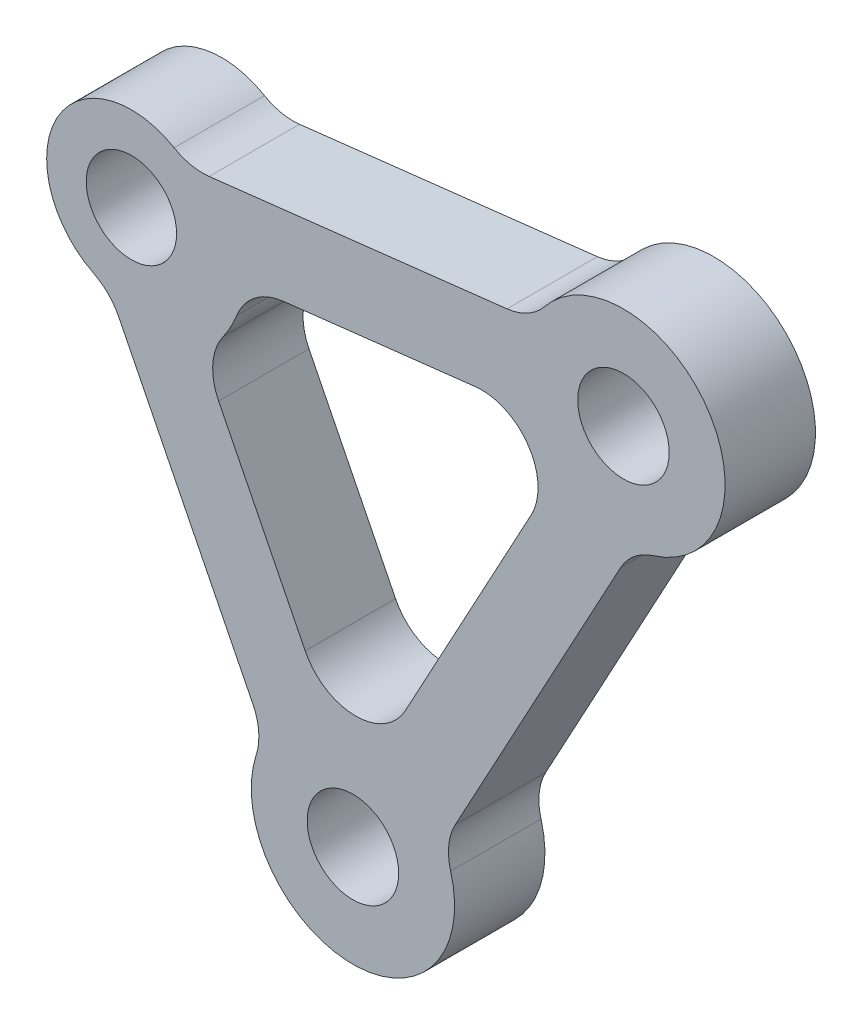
ISO-10303-21;
HEADER;
FILE_DESCRIPTION(('STEP AP214'),'2;1');
FILE_NAME('part.step','',(''),(''),'','','');
FILE_SCHEMA(('AUTOMOTIVE_DESIGN { 1 0 10303 214 1 1 1 1 }'));
ENDSEC;
DATA;
#1=APPLICATION_CONTEXT('core data for automotive mechanical design processes');
#2=APPLICATION_PROTOCOL_DEFINITION('international standard','automotive_design',2000,#1);
#3=PRODUCT_CONTEXT('',#1,'mechanical');
#4=PRODUCT('Part','Part','',(#3));
#5=PRODUCT_RELATED_PRODUCT_CATEGORY('part','',(#4));
#6=PRODUCT_DEFINITION_FORMATION('','',#4);
#7=PRODUCT_DEFINITION_CONTEXT('part definition',#1,'design');
#8=PRODUCT_DEFINITION('design','',#6,#7);
#9=PRODUCT_DEFINITION_SHAPE('','',#8);
#10=(LENGTH_UNIT() NAMED_UNIT(*) SI_UNIT(.MILLI.,.METRE.));
#11=(NAMED_UNIT(*) PLANE_ANGLE_UNIT() SI_UNIT($,.RADIAN.));
#12=(NAMED_UNIT(*) SI_UNIT($,.STERADIAN.) SOLID_ANGLE_UNIT());
#13=UNCERTAINTY_MEASURE_WITH_UNIT(LENGTH_MEASURE(1.E-05),#10,'distance_accuracy_value','');
#14=(GEOMETRIC_REPRESENTATION_CONTEXT(3) GLOBAL_UNCERTAINTY_ASSIGNED_CONTEXT((#13)) GLOBAL_UNIT_ASSIGNED_CONTEXT((#10,
#11,#12)) REPRESENTATION_CONTEXT('',''));
#15=CARTESIAN_POINT('',(0.,0.,0.));
#16=DIRECTION('',(0.,0.,1.));
#17=DIRECTION('',(1.,0.,0.));
#18=AXIS2_PLACEMENT_3D('',#15,#16,#17);
#19=CARTESIAN_POINT('',(16.022447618,205.375667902,-27.));
#20=DIRECTION('',(0.894403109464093,0.447261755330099,0.));
#21=DIRECTION('',(0.447261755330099,-0.894403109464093,0.));
#22=AXIS2_PLACEMENT_3D('',#19,#20,#21);
#23=PLANE('',#22);
#24=DIRECTION('',(0.,0.,-1.));
#25=VECTOR('',#24,1.);
#26=CARTESIAN_POINT('',(16.0224476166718,205.375667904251,-31.));
#27=LINE('',#26,#25);
#28=CARTESIAN_POINT('',(16.0224476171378,205.375667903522,-35.));
#29=VERTEX_POINT('',#28);
#30=CARTESIAN_POINT('',(16.0224476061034,205.37566790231,-27.));
#31=VERTEX_POINT('',#30);
#32=EDGE_CURVE('E308',#29,#31,#27,.F.);
#33=ORIENTED_EDGE('',*,*,#32,.F.);
#34=DIRECTION('',(0.447261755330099,-0.894403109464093,0.));
#35=VECTOR('',#34,1.);
#36=CARTESIAN_POINT('',(16.022447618,205.375667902,-35.));
#37=LINE('',#36,#35);
#38=CARTESIAN_POINT('',(27.8971255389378,181.629508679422,-35.));
#39=VERTEX_POINT('',#38);
#40=EDGE_CURVE('E249',#29,#39,#37,.T.);
#41=ORIENTED_EDGE('',*,*,#40,.T.);
#42=DIRECTION('',(0.,0.,1.));
#43=VECTOR('',#42,1.);
#44=CARTESIAN_POINT('',(27.8971255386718,181.629508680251,-31.));
#45=LINE('',#44,#43);
#46=CARTESIAN_POINT('',(27.8971255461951,181.629508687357,-27.));
#47=VERTEX_POINT('',#46);
#48=EDGE_CURVE('E185',#47,#39,#45,.F.);
#49=ORIENTED_EDGE('',*,*,#48,.F.);
#50=DIRECTION('',(0.44726175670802,-0.89440310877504,0.));
#51=VECTOR('',#50,1.);
#52=CARTESIAN_POINT('',(16.0224475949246,205.37566790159,-27.));
#53=LINE('',#52,#51);
#54=EDGE_CURVE('E290',#31,#47,#53,.T.);
#55=ORIENTED_EDGE('',*,*,#54,.F.);
#56=EDGE_LOOP('',(#33,#41,#49,#55));
#57=FACE_BOUND('',#56,.T.);
#58=ADVANCED_FACE('F12',(#57),#23,.F.);
#59=CARTESIAN_POINT('',(23.425109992,179.393199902,-35.));
#60=DIRECTION('',(0.,0.,1.));
#61=DIRECTION('',(1.,0.,0.));
#62=AXIS2_PLACEMENT_3D('',#59,#60,#61);
#63=CYLINDRICAL_SURFACE('',#62,5.00000000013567);
#64=CARTESIAN_POINT('',(23.425109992,179.393199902,-35.));
#65=DIRECTION('',(0.,0.,1.));
#66=DIRECTION('',(1.,0.,0.));
#67=AXIS2_PLACEMENT_3D('',#64,#65,#66);
#68=CIRCLE('',#67,5.00000000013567);
#69=CARTESIAN_POINT('',(28.184496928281,177.860804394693,-35.));
#70=VERTEX_POINT('',#69);
#71=EDGE_CURVE('E246',#39,#70,#68,.F.);
#72=ORIENTED_EDGE('',*,*,#71,.T.);
#73=DIRECTION('',(0.,0.,-1.));
#74=VECTOR('',#73,1.);
#75=CARTESIAN_POINT('',(28.184496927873,177.860804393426,-31.));
#76=LINE('',#75,#74);
#77=CARTESIAN_POINT('',(28.1844969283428,177.860804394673,-27.));
#78=VERTEX_POINT('',#77);
#79=EDGE_CURVE('E182',#70,#78,#76,.F.);
#80=ORIENTED_EDGE('',*,*,#79,.T.);
#81=CARTESIAN_POINT('',(23.425109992,179.393199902,-27.));
#82=DIRECTION('',(0.,0.,1.));
#83=DIRECTION('',(1.,0.,0.));
#84=AXIS2_PLACEMENT_3D('',#81,#82,#83);
#85=CIRCLE('',#84,5.00000000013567);
#86=EDGE_CURVE('E289',#47,#78,#85,.F.);
#87=ORIENTED_EDGE('',*,*,#86,.F.);
#88=ORIENTED_EDGE('',*,*,#48,.T.);
#89=EDGE_LOOP('',(#72,#80,#87,#88));
#90=FACE_BOUND('',#89,.T.);
#91=ADVANCED_FACE('F341',(#90),#63,.F.);
#92=CARTESIAN_POINT('',(36.751393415,175.102492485,-35.));
#93=DIRECTION('',(0.,0.,1.));
#94=DIRECTION('',(1.,0.,0.));
#95=AXIS2_PLACEMENT_3D('',#92,#93,#94);
#96=CYLINDRICAL_SURFACE('',#95,9.00000000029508);
#97=ORIENTED_EDGE('',*,*,#79,.F.);
#98=CARTESIAN_POINT('',(36.751393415,175.102492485,-35.));
#99=DIRECTION('',(0.,0.,1.));
#100=DIRECTION('',(1.,0.,0.));
#101=AXIS2_PLACEMENT_3D('',#98,#99,#100);
#102=CIRCLE('',#101,9.00000000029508);
#103=CARTESIAN_POINT('',(45.4034651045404,177.580728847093,-35.));
#104=VERTEX_POINT('',#103);
#105=EDGE_CURVE('E243',#70,#104,#102,.T.);
#106=ORIENTED_EDGE('',*,*,#105,.T.);
#107=DIRECTION('',(0.,0.,1.));
#108=VECTOR('',#107,1.);
#109=CARTESIAN_POINT('',(45.4034651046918,177.580728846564,-31.));
#110=LINE('',#109,#108);
#111=CARTESIAN_POINT('',(45.4034651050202,177.58072884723,-27.));
#112=VERTEX_POINT('',#111);
#113=EDGE_CURVE('E180',#112,#104,#110,.F.);
#114=ORIENTED_EDGE('',*,*,#113,.F.);
#115=CARTESIAN_POINT('',(36.751393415,175.102492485,-27.));
#116=DIRECTION('',(0.,0.,1.));
#117=DIRECTION('',(1.,0.,0.));
#118=AXIS2_PLACEMENT_3D('',#115,#116,#117);
#119=CIRCLE('',#118,9.00000000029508);
#120=EDGE_CURVE('E287',#78,#112,#119,.T.);
#121=ORIENTED_EDGE('',*,*,#120,.F.);
#122=EDGE_LOOP('',(#97,#106,#114,#121));
#123=FACE_BOUND('',#122,.T.);
#124=ADVANCED_FACE('F346',(#123),#96,.T.);
#125=CARTESIAN_POINT('',(50.210171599,178.957526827,-35.));
#126=DIRECTION('',(0.,0.,1.));
#127=DIRECTION('',(1.,0.,0.));
#128=AXIS2_PLACEMENT_3D('',#125,#126,#127);
#129=CYLINDRICAL_SURFACE('',#128,5.00000000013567);
#130=CARTESIAN_POINT('',(50.210171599,178.957526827,-35.));
#131=DIRECTION('',(0.,0.,1.));
#132=DIRECTION('',(1.,0.,0.));
#133=AXIS2_PLACEMENT_3D('',#130,#131,#132);
#134=CIRCLE('',#133,5.00000000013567);
#135=CARTESIAN_POINT('',(45.8132519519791,181.338093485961,-35.));
#136=VERTEX_POINT('',#135);
#137=EDGE_CURVE('E240',#104,#136,#134,.F.);
#138=ORIENTED_EDGE('',*,*,#137,.T.);
#139=DIRECTION('',(0.,0.,1.));
#140=VECTOR('',#139,1.);
#141=CARTESIAN_POINT('',(45.813251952,181.338093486,-31.));
#142=LINE('',#141,#140);
#143=CARTESIAN_POINT('',(45.8132519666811,181.338093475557,-27.));
#144=VERTEX_POINT('',#143);
#145=EDGE_CURVE('E174',#136,#144,#142,.T.);
#146=ORIENTED_EDGE('',*,*,#145,.T.);
#147=CARTESIAN_POINT('',(50.210171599,178.957526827,-27.));
#148=DIRECTION('',(0.,0.,1.));
#149=DIRECTION('',(1.,0.,0.));
#150=AXIS2_PLACEMENT_3D('',#147,#148,#149);
#151=CIRCLE('',#150,5.00000000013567);
#152=EDGE_CURVE('E285',#112,#144,#151,.F.);
#153=ORIENTED_EDGE('',*,*,#152,.F.);
#154=ORIENTED_EDGE('',*,*,#113,.T.);
#155=EDGE_LOOP('',(#138,#146,#153,#154));
#156=FACE_BOUND('',#155,.T.);
#157=ADVANCED_FACE('F349',(#156),#129,.F.);
#158=CARTESIAN_POINT('',(45.813251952,181.338093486,-27.));
#159=DIRECTION('',(-0.879383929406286,0.476113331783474,0.));
#160=DIRECTION('',(0.476113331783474,0.879383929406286,0.));
#161=AXIS2_PLACEMENT_3D('',#158,#159,#160);
#162=PLANE('',#161);
#163=ORIENTED_EDGE('',*,*,#145,.F.);
#164=DIRECTION('',(0.476113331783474,0.879383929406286,0.));
#165=VECTOR('',#164,1.);
#166=CARTESIAN_POINT('',(45.813251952,181.338093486,-35.));
#167=LINE('',#166,#165);
#168=CARTESIAN_POINT('',(60.4318747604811,208.338769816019,-35.));
#169=VERTEX_POINT('',#168);
#170=EDGE_CURVE('E237',#136,#169,#167,.T.);
#171=ORIENTED_EDGE('',*,*,#170,.T.);
#172=DIRECTION('',(0.,0.,1.));
#173=VECTOR('',#172,1.);
#174=CARTESIAN_POINT('',(60.431874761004,208.338769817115,-31.));
#175=LINE('',#174,#173);
#176=CARTESIAN_POINT('',(60.4318747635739,208.3387698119,-27.));
#177=VERTEX_POINT('',#176);
#178=EDGE_CURVE('E170',#177,#169,#175,.F.);
#179=ORIENTED_EDGE('',*,*,#178,.F.);
#180=DIRECTION('',(0.476113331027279,0.879383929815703,0.));
#181=VECTOR('',#180,1.);
#182=CARTESIAN_POINT('',(45.8132519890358,181.338093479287,-27.));
#183=LINE('',#182,#181);
#184=EDGE_CURVE('E151',#144,#177,#183,.T.);
#185=ORIENTED_EDGE('',*,*,#184,.F.);
#186=EDGE_LOOP('',(#163,#171,#179,#185));
#187=FACE_BOUND('',#186,.T.);
#188=ADVANCED_FACE('F352',(#187),#162,.F.);
#189=CARTESIAN_POINT('',(64.828794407,205.958203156,-35.));
#190=DIRECTION('',(0.,0.,1.));
#191=DIRECTION('',(1.,0.,0.));
#192=AXIS2_PLACEMENT_3D('',#189,#190,#191);
#193=CYLINDRICAL_SURFACE('',#192,5.00000000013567);
#194=CARTESIAN_POINT('',(64.828794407,205.958203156,-27.));
#195=DIRECTION('',(0.,0.,1.));
#196=DIRECTION('',(1.,0.,0.));
#197=AXIS2_PLACEMENT_3D('',#194,#195,#196);
#198=CIRCLE('',#197,5.00000000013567);
#199=CARTESIAN_POINT('',(63.3541871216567,210.735810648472,-27.));
#200=VERTEX_POINT('',#199);
#201=EDGE_CURVE('E144',#177,#200,#198,.F.);
#202=ORIENTED_EDGE('',*,*,#201,.F.);
#203=ORIENTED_EDGE('',*,*,#178,.T.);
#204=CARTESIAN_POINT('',(64.828794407,205.958203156,-35.));
#205=DIRECTION('',(0.,0.,1.));
#206=DIRECTION('',(1.,0.,0.));
#207=AXIS2_PLACEMENT_3D('',#204,#205,#206);
#208=CIRCLE('',#207,5.00000000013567);
#209=CARTESIAN_POINT('',(63.3541871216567,210.735810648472,-35.));
#210=VERTEX_POINT('',#209);
#211=EDGE_CURVE('E168',#169,#210,#208,.F.);
#212=ORIENTED_EDGE('',*,*,#211,.T.);
#213=DIRECTION('',(0.,0.,-1.));
#214=VECTOR('',#213,1.);
#215=CARTESIAN_POINT('',(63.3541871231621,210.735810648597,-31.));
#216=LINE('',#215,#214);
#217=EDGE_CURVE('E160',#210,#200,#216,.F.);
#218=ORIENTED_EDGE('',*,*,#217,.T.);
#219=EDGE_LOOP('',(#202,#203,#212,#218));
#220=FACE_BOUND('',#219,.T.);
#221=ADVANCED_FACE('F166',(#220),#193,.F.);
#222=CARTESIAN_POINT('',(60.699894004,219.335504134,-35.));
#223=DIRECTION('',(0.,0.,1.));
#224=DIRECTION('',(1.,0.,0.));
#225=AXIS2_PLACEMENT_3D('',#222,#223,#224);
#226=CYLINDRICAL_SURFACE('',#225,9.0000000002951);
#227=CARTESIAN_POINT('',(60.699894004,219.335504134,-35.));
#228=DIRECTION('',(0.,0.,1.));
#229=DIRECTION('',(1.,0.,0.));
#230=AXIS2_PLACEMENT_3D('',#227,#228,#229);
#231=CIRCLE('',#230,9.0000000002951);
#232=CARTESIAN_POINT('',(53.7072171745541,225.001408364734,-35.));
#233=VERTEX_POINT('',#232);
#234=EDGE_CURVE('E234',#210,#233,#231,.T.);
#235=ORIENTED_EDGE('',*,*,#234,.T.);
#236=DIRECTION('',(0.,0.,1.));
#237=VECTOR('',#236,1.);
#238=CARTESIAN_POINT('',(53.7072171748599,225.001408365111,-31.));
#239=LINE('',#238,#237);
#240=CARTESIAN_POINT('',(53.7072171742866,225.001408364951,-27.));
#241=VERTEX_POINT('',#240);
#242=EDGE_CURVE('E161',#241,#233,#239,.F.);
#243=ORIENTED_EDGE('',*,*,#242,.F.);
#244=CARTESIAN_POINT('',(60.699894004,219.335504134,-27.));
#245=DIRECTION('',(0.,0.,1.));
#246=DIRECTION('',(1.,0.,0.));
#247=AXIS2_PLACEMENT_3D('',#244,#245,#246);
#248=CIRCLE('',#247,9.0000000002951);
#249=EDGE_CURVE('E148',#200,#241,#248,.T.);
#250=ORIENTED_EDGE('',*,*,#249,.F.);
#251=ORIENTED_EDGE('',*,*,#217,.F.);
#252=EDGE_LOOP('',(#235,#243,#250,#251));
#253=FACE_BOUND('',#252,.T.);
#254=ADVANCED_FACE('F159',(#253),#226,.T.);
#255=CARTESIAN_POINT('',(49.822396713,228.149132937,-35.));
#256=DIRECTION('',(0.,0.,1.));
#257=DIRECTION('',(1.,0.,0.));
#258=AXIS2_PLACEMENT_3D('',#255,#256,#257);
#259=CYLINDRICAL_SURFACE('',#258,5.00000000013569);
#260=CARTESIAN_POINT('',(49.822396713,228.149132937,-35.));
#261=DIRECTION('',(0.,0.,1.));
#262=DIRECTION('',(1.,0.,0.));
#263=AXIS2_PLACEMENT_3D('',#260,#261,#262);
#264=CIRCLE('',#263,5.00000000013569);
#265=CARTESIAN_POINT('',(50.3943201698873,223.181950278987,-35.));
#266=VERTEX_POINT('',#265);
#267=EDGE_CURVE('E231',#233,#266,#264,.F.);
#268=ORIENTED_EDGE('',*,*,#267,.T.);
#269=DIRECTION('',(0.,0.,1.));
#270=VECTOR('',#269,1.);
#271=CARTESIAN_POINT('',(50.39432017,223.181950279,-31.));
#272=LINE('',#271,#270);
#273=CARTESIAN_POINT('',(50.3943201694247,223.181950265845,-27.));
#274=VERTEX_POINT('',#273);
#275=EDGE_CURVE('E172',#266,#274,#272,.T.);
#276=ORIENTED_EDGE('',*,*,#275,.T.);
#277=CARTESIAN_POINT('',(49.822396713,228.149132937,-27.));
#278=DIRECTION('',(0.,0.,1.));
#279=DIRECTION('',(1.,0.,0.));
#280=AXIS2_PLACEMENT_3D('',#277,#278,#279);
#281=CIRCLE('',#280,5.00000000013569);
#282=EDGE_CURVE('E163',#241,#274,#281,.F.);
#283=ORIENTED_EDGE('',*,*,#282,.F.);
#284=ORIENTED_EDGE('',*,*,#242,.T.);
#285=EDGE_LOOP('',(#268,#276,#283,#284));
#286=FACE_BOUND('',#285,.T.);
#287=ADVANCED_FACE('F317',(#286),#259,.F.);
#288=CARTESIAN_POINT('',(50.39432017,223.181950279,-27.));
#289=DIRECTION('',(0.11438469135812,-0.993436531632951,0.));
#290=DIRECTION('',(-0.993436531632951,-0.11438469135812,0.));
#291=AXIS2_PLACEMENT_3D('',#288,#289,#290);
#292=PLANE('',#291);
#293=ORIENTED_EDGE('',*,*,#275,.F.);
#294=DIRECTION('',(-0.993436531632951,-0.11438469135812,0.));
#295=VECTOR('',#294,1.);
#296=CARTESIAN_POINT('',(50.39432017,223.181950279,-35.));
#297=LINE('',#296,#295);
#298=CARTESIAN_POINT('',(24.0188505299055,220.145067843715,-35.));
#299=VERTEX_POINT('',#298);
#300=EDGE_CURVE('E228',#266,#299,#297,.T.);
#301=ORIENTED_EDGE('',*,*,#300,.T.);
#302=DIRECTION('',(0.,0.,1.));
#303=VECTOR('',#302,1.);
#304=CARTESIAN_POINT('',(24.0188505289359,220.145067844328,-31.));
#305=LINE('',#304,#303);
#306=CARTESIAN_POINT('',(24.0188505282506,220.145067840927,-27.));
#307=VERTEX_POINT('',#306);
#308=EDGE_CURVE('E313',#307,#299,#305,.F.);
#309=ORIENTED_EDGE('',*,*,#308,.F.);
#310=DIRECTION('',(-0.993436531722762,-0.114384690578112,0.));
#311=VECTOR('',#310,1.);
#312=CARTESIAN_POINT('',(50.3943201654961,223.181950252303,-27.));
#313=LINE('',#312,#311);
#314=EDGE_CURVE('E281',#274,#307,#313,.T.);
#315=ORIENTED_EDGE('',*,*,#314,.F.);
#316=EDGE_LOOP('',(#293,#301,#309,#315));
#317=FACE_BOUND('',#316,.T.);
#318=ADVANCED_FACE('F322',(#317),#292,.F.);
#319=CARTESIAN_POINT('',(23.446927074,225.112250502,-35.));
#320=DIRECTION('',(0.,0.,1.));
#321=DIRECTION('',(1.,0.,0.));
#322=AXIS2_PLACEMENT_3D('',#319,#320,#321);
#323=CYLINDRICAL_SURFACE('',#322,4.99999999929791);
#324=CARTESIAN_POINT('',(23.446927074,225.112250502,-35.));
#325=DIRECTION('',(0.,0.,1.));
#326=DIRECTION('',(1.,0.,0.));
#327=AXIS2_PLACEMENT_3D('',#324,#325,#326);
#328=CIRCLE('',#327,4.99999999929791);
#329=CARTESIAN_POINT('',(20.9241562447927,220.795350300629,-35.));
#330=VERTEX_POINT('',#329);
#331=EDGE_CURVE('E225',#299,#330,#328,.F.);
#332=ORIENTED_EDGE('',*,*,#331,.T.);
#333=DIRECTION('',(0.,0.,-1.));
#334=VECTOR('',#333,1.);
#335=CARTESIAN_POINT('',(20.924156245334,220.795350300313,-31.));
#336=LINE('',#335,#334);
#337=CARTESIAN_POINT('',(20.9241562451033,220.795350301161,-27.));
#338=VERTEX_POINT('',#337);
#339=EDGE_CURVE('E309',#330,#338,#336,.F.);
#340=ORIENTED_EDGE('',*,*,#339,.T.);
#341=CARTESIAN_POINT('',(23.446927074,225.112250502,-27.));
#342=DIRECTION('',(0.,0.,1.));
#343=DIRECTION('',(1.,0.,0.));
#344=AXIS2_PLACEMENT_3D('',#341,#342,#343);
#345=CIRCLE('',#344,4.99999999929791);
#346=EDGE_CURVE('E279',#307,#338,#345,.F.);
#347=ORIENTED_EDGE('',*,*,#346,.F.);
#348=ORIENTED_EDGE('',*,*,#308,.T.);
#349=EDGE_LOOP('',(#332,#340,#347,#348));
#350=FACE_BOUND('',#349,.T.);
#351=ADVANCED_FACE('F326',(#350),#323,.F.);
#352=CARTESIAN_POINT('',(17.14,214.32,-35.));
#353=DIRECTION('',(0.,0.,1.));
#354=DIRECTION('',(1.,0.,0.));
#355=AXIS2_PLACEMENT_3D('',#352,#353,#354);
#356=CYLINDRICAL_SURFACE('',#355,7.50000000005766);
#357=CARTESIAN_POINT('',(17.14,214.32,-35.));
#358=DIRECTION('',(0.,0.,1.));
#359=DIRECTION('',(1.,0.,0.));
#360=AXIS2_PLACEMENT_3D('',#357,#358,#359);
#361=CIRCLE('',#360,7.50000000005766);
#362=CARTESIAN_POINT('',(13.7862592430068,207.611615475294,-35.));
#363=VERTEX_POINT('',#362);
#364=EDGE_CURVE('E222',#330,#363,#361,.T.);
#365=ORIENTED_EDGE('',*,*,#364,.T.);
#366=DIRECTION('',(0.,0.,1.));
#367=VECTOR('',#366,1.);
#368=CARTESIAN_POINT('',(13.7862592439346,207.61161547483,-31.));
#369=LINE('',#368,#367);
#370=CARTESIAN_POINT('',(13.7862592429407,207.611615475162,-27.));
#371=VERTEX_POINT('',#370);
#372=EDGE_CURVE('E306',#371,#363,#369,.F.);
#373=ORIENTED_EDGE('',*,*,#372,.F.);
#374=CARTESIAN_POINT('',(17.14,214.32,-27.));
#375=DIRECTION('',(0.,0.,1.));
#376=DIRECTION('',(1.,0.,0.));
#377=AXIS2_PLACEMENT_3D('',#374,#375,#376);
#378=CIRCLE('',#377,7.50000000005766);
#379=EDGE_CURVE('E276',#338,#371,#378,.T.);
#380=ORIENTED_EDGE('',*,*,#379,.F.);
#381=ORIENTED_EDGE('',*,*,#339,.F.);
#382=EDGE_LOOP('',(#365,#373,#380,#381));
#383=FACE_BOUND('',#382,.T.);
#384=ADVANCED_FACE('F329',(#383),#356,.T.);
#385=CARTESIAN_POINT('',(11.55043207,203.139359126,-35.));
#386=DIRECTION('',(0.,0.,1.));
#387=DIRECTION('',(1.,0.,0.));
#388=AXIS2_PLACEMENT_3D('',#385,#386,#387);
#389=CYLINDRICAL_SURFACE('',#388,5.00000000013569);
#390=CARTESIAN_POINT('',(11.55043207,203.139359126,-35.));
#391=DIRECTION('',(0.,0.,1.));
#392=DIRECTION('',(1.,0.,0.));
#393=AXIS2_PLACEMENT_3D('',#390,#391,#392);
#394=CIRCLE('',#393,5.00000000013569);
#395=EDGE_CURVE('E219',#363,#29,#394,.F.);
#396=ORIENTED_EDGE('',*,*,#395,.T.);
#397=ORIENTED_EDGE('',*,*,#32,.T.);
#398=CARTESIAN_POINT('',(11.55043207,203.139359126,-27.));
#399=DIRECTION('',(0.,0.,1.));
#400=DIRECTION('',(1.,0.,0.));
#401=AXIS2_PLACEMENT_3D('',#398,#399,#400);
#402=CIRCLE('',#401,5.00000000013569);
#403=EDGE_CURVE('E16',#371,#31,#402,.F.);
#404=ORIENTED_EDGE('',*,*,#403,.F.);
#405=ORIENTED_EDGE('',*,*,#372,.T.);
#406=EDGE_LOOP('',(#396,#397,#404,#405));
#407=FACE_BOUND('',#406,.T.);
#408=ADVANCED_FACE('F332',(#407),#389,.F.);
#409=CARTESIAN_POINT('',(17.14,214.32,-27.));
#410=DIRECTION('',(0.,0.,-1.));
#411=DIRECTION('',(-1.,0.,0.));
#412=AXIS2_PLACEMENT_3D('',#409,#410,#411);
#413=CYLINDRICAL_SURFACE('',#412,10.0000000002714);
#414=DIRECTION('',(0.,0.,1.));
#415=VECTOR('',#414,1.);
#416=CARTESIAN_POINT('',(26.4600785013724,210.695619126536,-31.));
#417=LINE('',#416,#415);
#418=CARTESIAN_POINT('',(26.4600785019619,210.695619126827,-27.));
#419=VERTEX_POINT('',#418);
#420=CARTESIAN_POINT('',(26.4600785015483,210.695619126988,-35.));
#421=VERTEX_POINT('',#420);
#422=EDGE_CURVE('E304',#419,#421,#417,.F.);
#423=ORIENTED_EDGE('',*,*,#422,.F.);
#424=CARTESIAN_POINT('',(17.14,214.32,-27.));
#425=DIRECTION('',(0.,0.,-1.));
#426=DIRECTION('',(-1.,0.,0.));
#427=AXIS2_PLACEMENT_3D('',#424,#425,#426);
#428=CIRCLE('',#427,10.0000000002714);
#429=CARTESIAN_POINT('',(25.2696129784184,208.496822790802,-27.));
#430=VERTEX_POINT('',#429);
#431=EDGE_CURVE('E271',#430,#419,#428,.F.);
#432=ORIENTED_EDGE('',*,*,#431,.F.);
#433=DIRECTION('',(0.,0.,-1.));
#434=VECTOR('',#433,1.);
#435=CARTESIAN_POINT('',(25.2696129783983,208.496822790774,-31.));
#436=LINE('',#435,#434);
#437=CARTESIAN_POINT('',(25.2696129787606,208.496822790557,-35.));
#438=VERTEX_POINT('',#437);
#439=EDGE_CURVE('E294',#438,#430,#436,.F.);
#440=ORIENTED_EDGE('',*,*,#439,.F.);
#441=CARTESIAN_POINT('',(17.14,214.32,-35.));
#442=DIRECTION('',(0.,0.,-1.));
#443=DIRECTION('',(-1.,0.,0.));
#444=AXIS2_PLACEMENT_3D('',#441,#442,#443);
#445=CIRCLE('',#444,10.0000000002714);
#446=EDGE_CURVE('E213',#438,#421,#445,.F.);
#447=ORIENTED_EDGE('',*,*,#446,.T.);
#448=EDGE_LOOP('',(#423,#432,#440,#447));
#449=FACE_BOUND('',#448,.T.);
#450=ADVANCED_FACE('F390',(#449),#413,.T.);
#451=CARTESIAN_POINT('',(31.120117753,208.883428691,-27.));
#452=DIRECTION('',(0.,0.,-1.));
#453=DIRECTION('',(-1.,0.,0.));
#454=AXIS2_PLACEMENT_3D('',#451,#452,#453);
#455=CYLINDRICAL_SURFACE('',#454,5.00000000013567);
#456=CARTESIAN_POINT('',(31.120117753,208.883428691,-27.));
#457=DIRECTION('',(0.,0.,-1.));
#458=DIRECTION('',(-1.,0.,0.));
#459=AXIS2_PLACEMENT_3D('',#456,#457,#458);
#460=CIRCLE('',#459,5.00000000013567);
#461=CARTESIAN_POINT('',(30.5481942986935,213.850611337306,-27.));
#462=VERTEX_POINT('',#461);
#463=EDGE_CURVE('E269',#419,#462,#460,.T.);
#464=ORIENTED_EDGE('',*,*,#463,.F.);
#465=ORIENTED_EDGE('',*,*,#422,.T.);
#466=CARTESIAN_POINT('',(31.120117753,208.883428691,-35.));
#467=DIRECTION('',(0.,0.,-1.));
#468=DIRECTION('',(-1.,0.,0.));
#469=AXIS2_PLACEMENT_3D('',#466,#467,#468);
#470=CIRCLE('',#469,5.00000000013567);
#471=CARTESIAN_POINT('',(30.548194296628,213.850611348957,-35.));
#472=VERTEX_POINT('',#471);
#473=EDGE_CURVE('E210',#421,#472,#470,.T.);
#474=ORIENTED_EDGE('',*,*,#473,.T.);
#475=DIRECTION('',(0.,0.,1.));
#476=VECTOR('',#475,1.);
#477=CARTESIAN_POINT('',(30.548194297,213.850611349,-31.));
#478=LINE('',#477,#476);
#479=EDGE_CURVE('E442',#472,#462,#478,.T.);
#480=ORIENTED_EDGE('',*,*,#479,.T.);
#481=EDGE_LOOP('',(#464,#465,#474,#480));
#482=FACE_BOUND('',#481,.T.);
#483=ADVANCED_FACE('F393',(#482),#455,.F.);
#484=CARTESIAN_POINT('',(30.548194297,213.850611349,-27.));
#485=DIRECTION('',(-0.114384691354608,0.993436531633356,0.));
#486=DIRECTION('',(0.993436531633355,0.114384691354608,0.));
#487=AXIS2_PLACEMENT_3D('',#484,#485,#486);
#488=PLANE('',#487);
#489=DIRECTION('',(0.,0.,1.));
#490=VECTOR('',#489,1.);
#491=CARTESIAN_POINT('',(47.5700466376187,215.810514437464,-31.));
#492=LINE('',#491,#490);
#493=CARTESIAN_POINT('',(47.5700466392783,215.810514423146,-27.));
#494=VERTEX_POINT('',#493);
#495=CARTESIAN_POINT('',(47.5700466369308,215.810514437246,-35.));
#496=VERTEX_POINT('',#495);
#497=EDGE_CURVE('E300',#494,#496,#492,.F.);
#498=ORIENTED_EDGE('',*,*,#497,.F.);
#499=DIRECTION('',(0.993436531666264,0.114384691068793,0.));
#500=VECTOR('',#499,1.);
#501=CARTESIAN_POINT('',(30.5481942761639,213.850611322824,-27.));
#502=LINE('',#501,#500);
#503=EDGE_CURVE('E267',#462,#494,#502,.T.);
#504=ORIENTED_EDGE('',*,*,#503,.F.);
#505=ORIENTED_EDGE('',*,*,#479,.F.);
#506=DIRECTION('',(0.993436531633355,0.114384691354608,0.));
#507=VECTOR('',#506,1.);
#508=CARTESIAN_POINT('',(30.548194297,213.850611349,-35.));
#509=LINE('',#508,#507);
#510=EDGE_CURVE('E207',#472,#496,#509,.T.);
#511=ORIENTED_EDGE('',*,*,#510,.T.);
#512=EDGE_LOOP('',(#498,#504,#505,#511));
#513=FACE_BOUND('',#512,.T.);
#514=ADVANCED_FACE('F397',(#513),#488,.F.);
#515=CARTESIAN_POINT('',(48.141970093,210.843331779,-27.));
#516=DIRECTION('',(0.,0.,-1.));
#517=DIRECTION('',(-1.,0.,0.));
#518=AXIS2_PLACEMENT_3D('',#515,#516,#517);
#519=CYLINDRICAL_SURFACE('',#518,5.00000000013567);
#520=CARTESIAN_POINT('',(48.141970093,210.843331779,-27.));
#521=DIRECTION('',(0.,0.,-1.));
#522=DIRECTION('',(-1.,0.,0.));
#523=AXIS2_PLACEMENT_3D('',#520,#521,#522);
#524=CIRCLE('',#523,5.00000000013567);
#525=CARTESIAN_POINT('',(52.538889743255,208.462765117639,-27.));
#526=VERTEX_POINT('',#525);
#527=EDGE_CURVE('E265',#494,#526,#524,.T.);
#528=ORIENTED_EDGE('',*,*,#527,.F.);
#529=ORIENTED_EDGE('',*,*,#497,.T.);
#530=CARTESIAN_POINT('',(48.141970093,210.843331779,-35.));
#531=DIRECTION('',(0.,0.,-1.));
#532=DIRECTION('',(-1.,0.,0.));
#533=AXIS2_PLACEMENT_3D('',#530,#531,#532);
#534=CIRCLE('',#533,5.00000000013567);
#535=CARTESIAN_POINT('',(52.5388897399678,208.462765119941,-35.));
#536=VERTEX_POINT('',#535);
#537=EDGE_CURVE('E204',#496,#536,#534,.T.);
#538=ORIENTED_EDGE('',*,*,#537,.T.);
#539=DIRECTION('',(0.,0.,1.));
#540=VECTOR('',#539,1.);
#541=CARTESIAN_POINT('',(52.53888974,208.46276512,-31.));
#542=LINE('',#541,#540);
#543=EDGE_CURVE('E296',#536,#526,#542,.T.);
#544=ORIENTED_EDGE('',*,*,#543,.T.);
#545=EDGE_LOOP('',(#528,#529,#538,#544));
#546=FACE_BOUND('',#545,.T.);
#547=ADVANCED_FACE('F399',(#546),#519,.F.);
#548=CARTESIAN_POINT('',(52.53888974,208.46276512,-27.));
#549=DIRECTION('',(0.879383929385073,-0.476113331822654,0.));
#550=DIRECTION('',(-0.476113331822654,-0.879383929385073,0.));
#551=AXIS2_PLACEMENT_3D('',#548,#549,#550);
#552=PLANE('',#551);
#553=DIRECTION('',(0.,0.,1.));
#554=VECTOR('',#553,1.);
#555=CARTESIAN_POINT('',(41.3948619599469,187.879684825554,-31.));
#556=LINE('',#555,#554);
#557=CARTESIAN_POINT('',(41.3948619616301,187.879684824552,-27.));
#558=VERTEX_POINT('',#557);
#559=CARTESIAN_POINT('',(41.3948619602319,187.879684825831,-35.));
#560=VERTEX_POINT('',#559);
#561=EDGE_CURVE('E252',#558,#560,#556,.F.);
#562=ORIENTED_EDGE('',*,*,#561,.F.);
#563=DIRECTION('',(-0.476113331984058,-0.879383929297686,0.));
#564=VECTOR('',#563,1.);
#565=CARTESIAN_POINT('',(52.5388897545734,208.462765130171,-27.));
#566=LINE('',#565,#564);
#567=EDGE_CURVE('E262',#526,#558,#566,.T.);
#568=ORIENTED_EDGE('',*,*,#567,.F.);
#569=ORIENTED_EDGE('',*,*,#543,.F.);
#570=DIRECTION('',(-0.476113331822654,-0.879383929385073,0.));
#571=VECTOR('',#570,1.);
#572=CARTESIAN_POINT('',(52.53888974,208.46276512,-35.));
#573=LINE('',#572,#571);
#574=EDGE_CURVE('E201',#536,#560,#573,.T.);
#575=ORIENTED_EDGE('',*,*,#574,.T.);
#576=EDGE_LOOP('',(#562,#568,#569,#575));
#577=FACE_BOUND('',#576,.T.);
#578=ADVANCED_FACE('F402',(#577),#552,.F.);
#579=CARTESIAN_POINT('',(60.699894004,219.335504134,-35.));
#580=DIRECTION('',(0.,0.,1.));
#581=DIRECTION('',(1.,0.,0.));
#582=AXIS2_PLACEMENT_3D('',#579,#580,#581);
#583=CYLINDRICAL_SURFACE('',#582,4.04999999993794);
#584=CARTESIAN_POINT('',(60.699894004,219.335504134,-27.));
#585=DIRECTION('',(0.,0.,1.));
#586=DIRECTION('',(1.,0.,0.));
#587=AXIS2_PLACEMENT_3D('',#584,#585,#586);
#588=CIRCLE('',#587,4.04999999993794);
#589=CARTESIAN_POINT('',(64.7498940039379,219.335504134,-27.));
#590=VERTEX_POINT('',#589);
#591=EDGE_CURVE('E259',#590,#590,#588,.F.);
#592=ORIENTED_EDGE('',*,*,#591,.F.);
#593=EDGE_LOOP('',(#592));
#594=FACE_BOUND('',#593,.T.);
#595=CARTESIAN_POINT('',(60.699894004,219.335504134,-35.));
#596=DIRECTION('',(0.,0.,1.));
#597=DIRECTION('',(1.,0.,0.));
#598=AXIS2_PLACEMENT_3D('',#595,#596,#597);
#599=CIRCLE('',#598,4.04999999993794);
#600=CARTESIAN_POINT('',(64.7498940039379,219.335504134,-35.));
#601=VERTEX_POINT('',#600);
#602=EDGE_CURVE('E198',#601,#601,#599,.F.);
#603=ORIENTED_EDGE('',*,*,#602,.T.);
#604=EDGE_LOOP('',(#603));
#605=FACE_BOUND('',#604,.T.);
#606=ADVANCED_FACE('F404',(#594,#605),#583,.F.);
#607=CARTESIAN_POINT('',(17.14,214.32,-35.));
#608=DIRECTION('',(0.,0.,1.));
#609=DIRECTION('',(1.,0.,0.));
#610=AXIS2_PLACEMENT_3D('',#607,#608,#609);
#611=CYLINDRICAL_SURFACE('',#610,4.00000000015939);
#612=CARTESIAN_POINT('',(17.14,214.32,-27.));
#613=DIRECTION('',(0.,0.,1.));
#614=DIRECTION('',(1.,0.,0.));
#615=AXIS2_PLACEMENT_3D('',#612,#613,#614);
#616=CIRCLE('',#615,4.00000000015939);
#617=CARTESIAN_POINT('',(21.1400000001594,214.32,-27.));
#618=VERTEX_POINT('',#617);
#619=EDGE_CURVE('E256',#618,#618,#616,.F.);
#620=ORIENTED_EDGE('',*,*,#619,.F.);
#621=EDGE_LOOP('',(#620));
#622=FACE_BOUND('',#621,.T.);
#623=CARTESIAN_POINT('',(17.14,214.32,-35.));
#624=DIRECTION('',(0.,0.,1.));
#625=DIRECTION('',(1.,0.,0.));
#626=AXIS2_PLACEMENT_3D('',#623,#624,#625);
#627=CIRCLE('',#626,4.00000000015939);
#628=CARTESIAN_POINT('',(21.1400000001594,214.32,-35.));
#629=VERTEX_POINT('',#628);
#630=EDGE_CURVE('E195',#629,#629,#627,.F.);
#631=ORIENTED_EDGE('',*,*,#630,.T.);
#632=EDGE_LOOP('',(#631));
#633=FACE_BOUND('',#632,.T.);
#634=ADVANCED_FACE('F407',(#622,#633),#611,.F.);
#635=CARTESIAN_POINT('',(36.751393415,175.102492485,-35.));
#636=DIRECTION('',(0.,0.,1.));
#637=DIRECTION('',(1.,0.,0.));
#638=AXIS2_PLACEMENT_3D('',#635,#636,#637);
#639=CYLINDRICAL_SURFACE('',#638,4.04999999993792);
#640=CARTESIAN_POINT('',(36.751393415,175.102492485,-27.));
#641=DIRECTION('',(0.,0.,1.));
#642=DIRECTION('',(1.,0.,0.));
#643=AXIS2_PLACEMENT_3D('',#640,#641,#642);
#644=CIRCLE('',#643,4.04999999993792);
#645=CARTESIAN_POINT('',(40.8013934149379,175.102492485,-27.));
#646=VERTEX_POINT('',#645);
#647=EDGE_CURVE('E253',#646,#646,#644,.F.);
#648=ORIENTED_EDGE('',*,*,#647,.F.);
#649=EDGE_LOOP('',(#648));
#650=FACE_BOUND('',#649,.T.);
#651=CARTESIAN_POINT('',(36.751393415,175.102492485,-35.));
#652=DIRECTION('',(0.,0.,1.));
#653=DIRECTION('',(1.,0.,0.));
#654=AXIS2_PLACEMENT_3D('',#651,#652,#653);
#655=CIRCLE('',#654,4.04999999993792);
#656=CARTESIAN_POINT('',(40.8013934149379,175.102492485,-35.));
#657=VERTEX_POINT('',#656);
#658=EDGE_CURVE('E191',#657,#657,#655,.F.);
#659=ORIENTED_EDGE('',*,*,#658,.T.);
#660=EDGE_LOOP('',(#659));
#661=FACE_BOUND('',#660,.T.);
#662=ADVANCED_FACE('F410',(#650,#661),#639,.F.);
#663=CARTESIAN_POINT('',(29.334419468,205.585234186,-27.));
#664=DIRECTION('',(0.,0.,-1.));
#665=DIRECTION('',(-1.,0.,0.));
#666=AXIS2_PLACEMENT_3D('',#663,#664,#665);
#667=CYLINDRICAL_SURFACE('',#666,5.00000000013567);
#668=CARTESIAN_POINT('',(29.334419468,205.585234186,-27.));
#669=DIRECTION('',(0.,0.,-1.));
#670=DIRECTION('',(-1.,0.,0.));
#671=AXIS2_PLACEMENT_3D('',#668,#669,#670);
#672=CIRCLE('',#671,5.00000000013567);
#673=CARTESIAN_POINT('',(24.862403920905,203.34892540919,-27.));
#674=VERTEX_POINT('',#673);
#675=EDGE_CURVE('E273',#674,#430,#672,.T.);
#676=ORIENTED_EDGE('',*,*,#675,.F.);
#677=DIRECTION('',(0.,0.,-1.));
#678=VECTOR('',#677,1.);
#679=CARTESIAN_POINT('',(24.862403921,203.348925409,-31.));
#680=LINE('',#679,#678);
#681=CARTESIAN_POINT('',(24.862403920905,203.34892540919,-35.));
#682=VERTEX_POINT('',#681);
#683=EDGE_CURVE('E446',#674,#682,#680,.T.);
#684=ORIENTED_EDGE('',*,*,#683,.T.);
#685=CARTESIAN_POINT('',(29.334419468,205.585234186,-35.));
#686=DIRECTION('',(0.,0.,-1.));
#687=DIRECTION('',(-1.,0.,0.));
#688=AXIS2_PLACEMENT_3D('',#685,#686,#687);
#689=CIRCLE('',#688,5.00000000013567);
#690=EDGE_CURVE('E216',#682,#438,#689,.T.);
#691=ORIENTED_EDGE('',*,*,#690,.T.);
#692=ORIENTED_EDGE('',*,*,#439,.T.);
#693=EDGE_LOOP('',(#676,#684,#691,#692));
#694=FACE_BOUND('',#693,.T.);
#695=ADVANCED_FACE('F370',(#694),#667,.F.);
#696=CARTESIAN_POINT('',(86.757496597,196.523565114,-27.));
#697=DIRECTION('',(0.,0.,1.));
#698=DIRECTION('',(-0.546051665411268,0.837751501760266,0.));
#699=AXIS2_PLACEMENT_3D('',#696,#697,#698);
#700=PLANE('',#699);
#701=ORIENTED_EDGE('',*,*,#647,.T.);
#702=EDGE_LOOP('',(#701));
#703=FACE_BOUND('',#702,.T.);
#704=ORIENTED_EDGE('',*,*,#619,.T.);
#705=EDGE_LOOP('',(#704));
#706=FACE_BOUND('',#705,.T.);
#707=ORIENTED_EDGE('',*,*,#591,.T.);
#708=EDGE_LOOP('',(#707));
#709=FACE_BOUND('',#708,.T.);
#710=ORIENTED_EDGE('',*,*,#527,.T.);
#711=ORIENTED_EDGE('',*,*,#567,.T.);
#712=CARTESIAN_POINT('',(36.997942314,190.260251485,-27.));
#713=DIRECTION('',(0.,0.,-1.));
#714=DIRECTION('',(-1.,0.,0.));
#715=AXIS2_PLACEMENT_3D('',#712,#713,#714);
#716=CIRCLE('',#715,4.99999999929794);
#717=CARTESIAN_POINT('',(32.5259267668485,188.023942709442,-27.));
#718=VERTEX_POINT('',#717);
#719=EDGE_CURVE('E188',#718,#558,#716,.F.);
#720=ORIENTED_EDGE('',*,*,#719,.F.);
#721=DIRECTION('',(-0.447261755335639,0.894403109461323,0.));
#722=VECTOR('',#721,1.);
#723=CARTESIAN_POINT('',(28.694165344,195.686434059,-27.));
#724=LINE('',#723,#722);
#725=EDGE_CURVE('E194',#718,#674,#724,.T.);
#726=ORIENTED_EDGE('',*,*,#725,.T.);
#727=ORIENTED_EDGE('',*,*,#675,.T.);
#728=ORIENTED_EDGE('',*,*,#431,.T.);
#729=ORIENTED_EDGE('',*,*,#463,.T.);
#730=ORIENTED_EDGE('',*,*,#503,.T.);
#731=EDGE_LOOP('',(#710,#711,#720,#726,#727,#728,#729,#730));
#732=FACE_BOUND('',#731,.T.);
#733=ORIENTED_EDGE('',*,*,#346,.T.);
#734=ORIENTED_EDGE('',*,*,#379,.T.);
#735=ORIENTED_EDGE('',*,*,#403,.T.);
#736=ORIENTED_EDGE('',*,*,#54,.T.);
#737=ORIENTED_EDGE('',*,*,#86,.T.);
#738=ORIENTED_EDGE('',*,*,#120,.T.);
#739=ORIENTED_EDGE('',*,*,#152,.T.);
#740=ORIENTED_EDGE('',*,*,#184,.T.);
#741=ORIENTED_EDGE('',*,*,#201,.T.);
#742=ORIENTED_EDGE('',*,*,#249,.T.);
#743=ORIENTED_EDGE('',*,*,#282,.T.);
#744=ORIENTED_EDGE('',*,*,#314,.T.);
#745=EDGE_LOOP('',(#733,#734,#735,#736,#737,#738,#739,#740,#741,#742,#743,#744));
#746=FACE_BOUND('',#745,.T.);
#747=ADVANCED_FACE('F147',(#703,#706,#709,#732,#746),#700,.T.);
#748=CARTESIAN_POINT('',(86.757496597,196.523565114,-35.));
#749=DIRECTION('',(0.,0.,1.));
#750=DIRECTION('',(-0.546051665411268,0.837751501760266,0.));
#751=AXIS2_PLACEMENT_3D('',#748,#749,#750);
#752=PLANE('',#751);
#753=ORIENTED_EDGE('',*,*,#658,.F.);
#754=EDGE_LOOP('',(#753));
#755=FACE_BOUND('',#754,.T.);
#756=ORIENTED_EDGE('',*,*,#630,.F.);
#757=EDGE_LOOP('',(#756));
#758=FACE_BOUND('',#757,.T.);
#759=ORIENTED_EDGE('',*,*,#602,.F.);
#760=EDGE_LOOP('',(#759));
#761=FACE_BOUND('',#760,.T.);
#762=CARTESIAN_POINT('',(36.997942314,190.260251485,-35.));
#763=DIRECTION('',(0.,0.,-1.));
#764=DIRECTION('',(-1.,0.,0.));
#765=AXIS2_PLACEMENT_3D('',#762,#763,#764);
#766=CIRCLE('',#765,4.99999999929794);
#767=CARTESIAN_POINT('',(32.5259267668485,188.023942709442,-35.));
#768=VERTEX_POINT('',#767);
#769=EDGE_CURVE('E22',#560,#768,#766,.T.);
#770=ORIENTED_EDGE('',*,*,#769,.F.);
#771=ORIENTED_EDGE('',*,*,#574,.F.);
#772=ORIENTED_EDGE('',*,*,#537,.F.);
#773=ORIENTED_EDGE('',*,*,#510,.F.);
#774=ORIENTED_EDGE('',*,*,#473,.F.);
#775=ORIENTED_EDGE('',*,*,#446,.F.);
#776=ORIENTED_EDGE('',*,*,#690,.F.);
#777=DIRECTION('',(0.447261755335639,-0.894403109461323,0.));
#778=VECTOR('',#777,1.);
#779=CARTESIAN_POINT('',(28.694165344,195.686434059,-35.));
#780=LINE('',#779,#778);
#781=EDGE_CURVE('E190',#682,#768,#780,.T.);
#782=ORIENTED_EDGE('',*,*,#781,.T.);
#783=EDGE_LOOP('',(#770,#771,#772,#773,#774,#775,#776,#782));
#784=FACE_BOUND('',#783,.T.);
#785=ORIENTED_EDGE('',*,*,#364,.F.);
#786=ORIENTED_EDGE('',*,*,#331,.F.);
#787=ORIENTED_EDGE('',*,*,#300,.F.);
#788=ORIENTED_EDGE('',*,*,#267,.F.);
#789=ORIENTED_EDGE('',*,*,#234,.F.);
#790=ORIENTED_EDGE('',*,*,#211,.F.);
#791=ORIENTED_EDGE('',*,*,#170,.F.);
#792=ORIENTED_EDGE('',*,*,#137,.F.);
#793=ORIENTED_EDGE('',*,*,#105,.F.);
#794=ORIENTED_EDGE('',*,*,#71,.F.);
#795=ORIENTED_EDGE('',*,*,#40,.F.);
#796=ORIENTED_EDGE('',*,*,#395,.F.);
#797=EDGE_LOOP('',(#785,#786,#787,#788,#789,#790,#791,#792,#793,#794,#795,#796));
#798=FACE_BOUND('',#797,.T.);
#799=ADVANCED_FACE('F334',(#755,#758,#761,#784,#798),#752,.F.);
#800=CARTESIAN_POINT('',(32.525926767,188.023942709,-27.));
#801=DIRECTION('',(-0.894403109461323,-0.447261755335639,0.));
#802=DIRECTION('',(-0.447261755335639,0.894403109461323,0.));
#803=AXIS2_PLACEMENT_3D('',#800,#801,#802);
#804=PLANE('',#803);
#805=ORIENTED_EDGE('',*,*,#683,.F.);
#806=ORIENTED_EDGE('',*,*,#725,.F.);
#807=DIRECTION('',(0.,0.,-1.));
#808=VECTOR('',#807,1.);
#809=CARTESIAN_POINT('',(32.525926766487,188.023942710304,-31.));
#810=LINE('',#809,#808);
#811=EDGE_CURVE('E9',#768,#718,#810,.F.);
#812=ORIENTED_EDGE('',*,*,#811,.F.);
#813=ORIENTED_EDGE('',*,*,#781,.F.);
#814=EDGE_LOOP('',(#805,#806,#812,#813));
#815=FACE_BOUND('',#814,.T.);
#816=ADVANCED_FACE('F14',(#815),#804,.F.);
#817=CARTESIAN_POINT('',(36.997942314,190.260251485,-27.));
#818=DIRECTION('',(0.,0.,-1.));
#819=DIRECTION('',(-1.,0.,0.));
#820=AXIS2_PLACEMENT_3D('',#817,#818,#819);
#821=CYLINDRICAL_SURFACE('',#820,4.99999999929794);
#822=ORIENTED_EDGE('',*,*,#769,.T.);
#823=ORIENTED_EDGE('',*,*,#811,.T.);
#824=ORIENTED_EDGE('',*,*,#719,.T.);
#825=ORIENTED_EDGE('',*,*,#561,.T.);
#826=EDGE_LOOP('',(#822,#823,#824,#825));
#827=FACE_BOUND('',#826,.T.);
#828=ADVANCED_FACE('F363',(#827),#821,.F.);
#829=CLOSED_SHELL('',(#58,#91,#124,#157,#188,#221,#254,#287,#318,#351,#384,#408,#450,#483,#514,
#547,#578,#606,#634,#662,#695,#747,#799,#816,#828));
#830=MANIFOLD_SOLID_BREP('B1',#829);
#831=ADVANCED_BREP_SHAPE_REPRESENTATION('',(#18,#830),#14);
#832=SHAPE_DEFINITION_REPRESENTATION(#9,#831);
ENDSEC;
END-ISO-10303-21;
